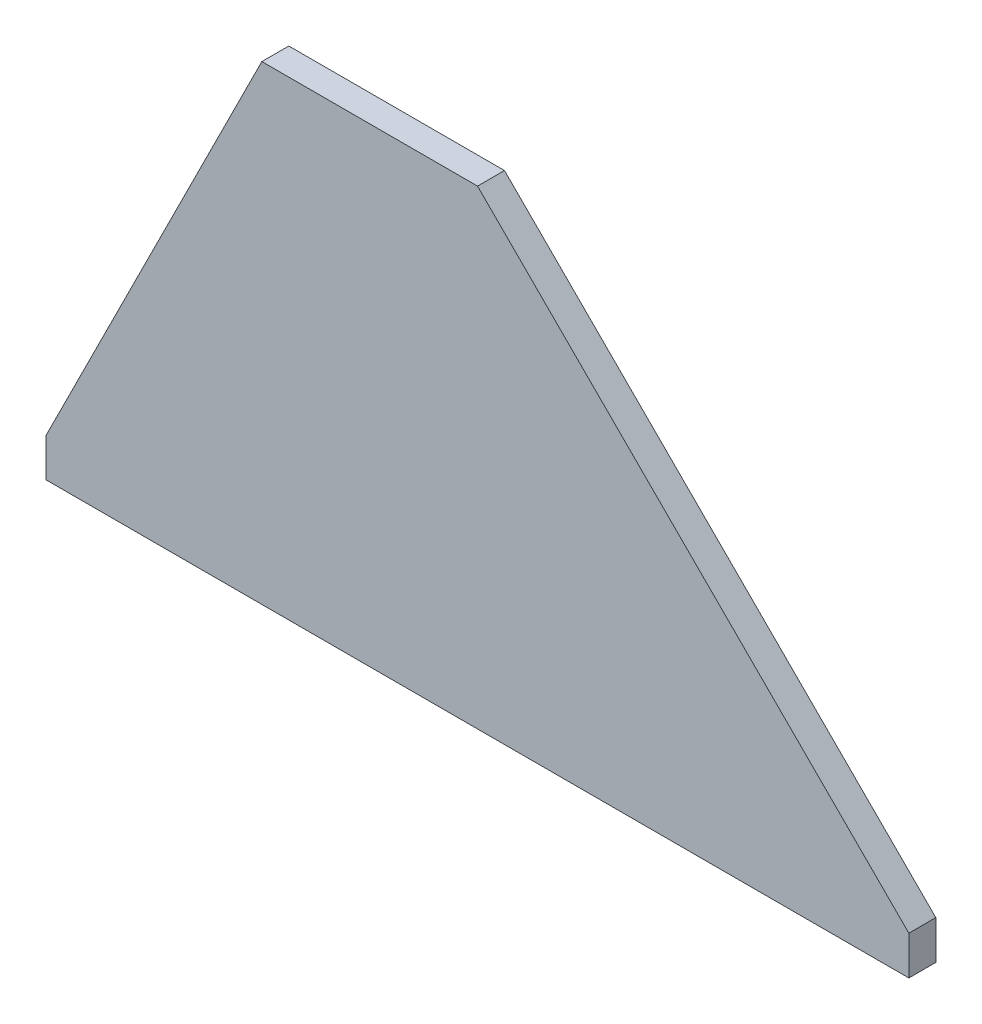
ISO-10303-21;
HEADER;
FILE_DESCRIPTION(('STEP AP214'),'2;1');
FILE_NAME('part.step','',(''),(''),'','','');
FILE_SCHEMA(('AUTOMOTIVE_DESIGN { 1 0 10303 214 1 1 1 1 }'));
ENDSEC;
DATA;
#1=APPLICATION_CONTEXT('core data for automotive mechanical design processes');
#2=APPLICATION_PROTOCOL_DEFINITION('international standard','automotive_design',2000,#1);
#3=PRODUCT_CONTEXT('',#1,'mechanical');
#4=PRODUCT('Part','Part','',(#3));
#5=PRODUCT_RELATED_PRODUCT_CATEGORY('part','',(#4));
#6=PRODUCT_DEFINITION_FORMATION('','',#4);
#7=PRODUCT_DEFINITION_CONTEXT('part definition',#1,'design');
#8=PRODUCT_DEFINITION('design','',#6,#7);
#9=PRODUCT_DEFINITION_SHAPE('','',#8);
#10=(LENGTH_UNIT() NAMED_UNIT(*) SI_UNIT(.MILLI.,.METRE.));
#11=(NAMED_UNIT(*) PLANE_ANGLE_UNIT() SI_UNIT($,.RADIAN.));
#12=(NAMED_UNIT(*) SI_UNIT($,.STERADIAN.) SOLID_ANGLE_UNIT());
#13=UNCERTAINTY_MEASURE_WITH_UNIT(LENGTH_MEASURE(1.E-05),#10,'distance_accuracy_value','');
#14=(GEOMETRIC_REPRESENTATION_CONTEXT(3) GLOBAL_UNCERTAINTY_ASSIGNED_CONTEXT((#13)) GLOBAL_UNIT_ASSIGNED_CONTEXT((#10,
#11,#12)) REPRESENTATION_CONTEXT('',''));
#15=CARTESIAN_POINT('',(0.,0.,0.));
#16=DIRECTION('',(0.,0.,1.));
#17=DIRECTION('',(1.,0.,0.));
#18=AXIS2_PLACEMENT_3D('',#15,#16,#17);
#19=CARTESIAN_POINT('',(0.,-4.572,3.175));
#20=DIRECTION('',(1.,0.,0.));
#21=DIRECTION('',(0.,0.,-1.));
#22=AXIS2_PLACEMENT_3D('',#19,#20,#21);
#23=PLANE('',#22);
#24=DIRECTION('',(0.,-1.,0.));
#25=VECTOR('',#24,1.);
#26=CARTESIAN_POINT('',(0.,-4.572,0.));
#27=LINE('',#26,#25);
#28=CARTESIAN_POINT('',(0.,0.,0.));
#29=VERTEX_POINT('',#28);
#30=CARTESIAN_POINT('',(0.,-4.572,0.));
#31=VERTEX_POINT('',#30);
#32=EDGE_CURVE('E87',#29,#31,#27,.T.);
#33=ORIENTED_EDGE('',*,*,#32,.T.);
#34=DIRECTION('',(0.,0.,-1.));
#35=VECTOR('',#34,1.);
#36=CARTESIAN_POINT('',(0.,-4.572,3.175));
#37=LINE('',#36,#35);
#38=CARTESIAN_POINT('',(0.,-4.572,3.175));
#39=VERTEX_POINT('',#38);
#40=EDGE_CURVE('E11',#39,#31,#37,.T.);
#41=ORIENTED_EDGE('',*,*,#40,.F.);
#42=DIRECTION('',(0.,-1.,0.));
#43=VECTOR('',#42,1.);
#44=CARTESIAN_POINT('',(0.,-4.572,3.175));
#45=LINE('',#44,#43);
#46=CARTESIAN_POINT('',(0.,0.,3.175));
#47=VERTEX_POINT('',#46);
#48=EDGE_CURVE('E110',#47,#39,#45,.T.);
#49=ORIENTED_EDGE('',*,*,#48,.F.);
#50=DIRECTION('',(0.,0.,-1.));
#51=VECTOR('',#50,1.);
#52=CARTESIAN_POINT('',(0.,0.,3.175));
#53=LINE('',#52,#51);
#54=EDGE_CURVE('E100',#47,#29,#53,.T.);
#55=ORIENTED_EDGE('',*,*,#54,.T.);
#56=EDGE_LOOP('',(#33,#41,#49,#55));
#57=FACE_BOUND('',#56,.T.);
#58=ADVANCED_FACE('F31',(#57),#23,.F.);
#59=CARTESIAN_POINT('',(0.,-4.572,3.175));
#60=DIRECTION('',(0.,1.,0.));
#61=DIRECTION('',(0.,0.,1.));
#62=AXIS2_PLACEMENT_3D('',#59,#60,#61);
#63=PLANE('',#62);
#64=DIRECTION('',(1.,0.,0.));
#65=VECTOR('',#64,1.);
#66=CARTESIAN_POINT('',(0.,-4.572,0.));
#67=LINE('',#66,#65);
#68=CARTESIAN_POINT('',(101.6,-4.572,0.));
#69=VERTEX_POINT('',#68);
#70=EDGE_CURVE('E83',#31,#69,#67,.T.);
#71=ORIENTED_EDGE('',*,*,#70,.T.);
#72=DIRECTION('',(0.,0.,-1.));
#73=VECTOR('',#72,1.);
#74=CARTESIAN_POINT('',(101.6,-4.572,3.175));
#75=LINE('',#74,#73);
#76=CARTESIAN_POINT('',(101.6,-4.572,3.175));
#77=VERTEX_POINT('',#76);
#78=EDGE_CURVE('E38',#77,#69,#75,.T.);
#79=ORIENTED_EDGE('',*,*,#78,.F.);
#80=DIRECTION('',(1.,0.,0.));
#81=VECTOR('',#80,1.);
#82=CARTESIAN_POINT('',(0.,-4.572,3.175));
#83=LINE('',#82,#81);
#84=EDGE_CURVE('E96',#39,#77,#83,.T.);
#85=ORIENTED_EDGE('',*,*,#84,.F.);
#86=ORIENTED_EDGE('',*,*,#40,.T.);
#87=EDGE_LOOP('',(#71,#79,#85,#86));
#88=FACE_BOUND('',#87,.T.);
#89=ADVANCED_FACE('F95',(#88),#63,.F.);
#90=CARTESIAN_POINT('',(101.6,0.,3.175));
#91=DIRECTION('',(-1.,0.,0.));
#92=DIRECTION('',(0.,0.,1.));
#93=AXIS2_PLACEMENT_3D('',#90,#91,#92);
#94=PLANE('',#93);
#95=DIRECTION('',(0.,1.,0.));
#96=VECTOR('',#95,1.);
#97=CARTESIAN_POINT('',(101.6,0.,0.));
#98=LINE('',#97,#96);
#99=CARTESIAN_POINT('',(101.6,0.,0.));
#100=VERTEX_POINT('',#99);
#101=EDGE_CURVE('E89',#69,#100,#98,.T.);
#102=ORIENTED_EDGE('',*,*,#101,.T.);
#103=DIRECTION('',(0.,0.,-1.));
#104=VECTOR('',#103,1.);
#105=CARTESIAN_POINT('',(101.6,0.,3.175));
#106=LINE('',#105,#104);
#107=CARTESIAN_POINT('',(101.6,0.,3.175));
#108=VERTEX_POINT('',#107);
#109=EDGE_CURVE('E126',#108,#100,#106,.T.);
#110=ORIENTED_EDGE('',*,*,#109,.F.);
#111=DIRECTION('',(0.,1.,0.));
#112=VECTOR('',#111,1.);
#113=CARTESIAN_POINT('',(101.6,0.,3.175));
#114=LINE('',#113,#112);
#115=EDGE_CURVE('E113',#77,#108,#114,.T.);
#116=ORIENTED_EDGE('',*,*,#115,.F.);
#117=ORIENTED_EDGE('',*,*,#78,.T.);
#118=EDGE_LOOP('',(#102,#110,#116,#117));
#119=FACE_BOUND('',#118,.T.);
#120=ADVANCED_FACE('F130',(#119),#94,.F.);
#121=CARTESIAN_POINT('',(101.6,0.,3.175));
#122=DIRECTION('',(-0.707106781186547,-0.707106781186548,0.));
#123=DIRECTION('',(0.707106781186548,-0.707106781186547,0.));
#124=AXIS2_PLACEMENT_3D('',#121,#122,#123);
#125=PLANE('',#124);
#126=DIRECTION('',(-0.707106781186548,0.707106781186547,0.));
#127=VECTOR('',#126,1.);
#128=CARTESIAN_POINT('',(101.6,0.,0.));
#129=LINE('',#128,#127);
#130=CARTESIAN_POINT('',(50.8,50.8,0.));
#131=VERTEX_POINT('',#130);
#132=EDGE_CURVE('E104',#100,#131,#129,.T.);
#133=ORIENTED_EDGE('',*,*,#132,.T.);
#134=DIRECTION('',(0.,0.,-1.));
#135=VECTOR('',#134,1.);
#136=CARTESIAN_POINT('',(50.8,50.8,3.175));
#137=LINE('',#136,#135);
#138=CARTESIAN_POINT('',(50.8,50.8,3.175));
#139=VERTEX_POINT('',#138);
#140=EDGE_CURVE('E123',#139,#131,#137,.T.);
#141=ORIENTED_EDGE('',*,*,#140,.F.);
#142=DIRECTION('',(-0.707106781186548,0.707106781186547,0.));
#143=VECTOR('',#142,1.);
#144=CARTESIAN_POINT('',(101.6,0.,3.175));
#145=LINE('',#144,#143);
#146=EDGE_CURVE('E115',#108,#139,#145,.T.);
#147=ORIENTED_EDGE('',*,*,#146,.F.);
#148=ORIENTED_EDGE('',*,*,#109,.T.);
#149=EDGE_LOOP('',(#133,#141,#147,#148));
#150=FACE_BOUND('',#149,.T.);
#151=ADVANCED_FACE('F136',(#150),#125,.F.);
#152=CARTESIAN_POINT('',(50.8,50.8,3.175));
#153=DIRECTION('',(0.,-1.,0.));
#154=DIRECTION('',(0.,0.,-1.));
#155=AXIS2_PLACEMENT_3D('',#152,#153,#154);
#156=PLANE('',#155);
#157=DIRECTION('',(-1.,0.,0.));
#158=VECTOR('',#157,1.);
#159=CARTESIAN_POINT('',(50.8,50.8,0.));
#160=LINE('',#159,#158);
#161=CARTESIAN_POINT('',(25.4,50.8,0.));
#162=VERTEX_POINT('',#161);
#163=EDGE_CURVE('E106',#131,#162,#160,.T.);
#164=ORIENTED_EDGE('',*,*,#163,.T.);
#165=DIRECTION('',(0.,0.,-1.));
#166=VECTOR('',#165,1.);
#167=CARTESIAN_POINT('',(25.4,50.8,3.175));
#168=LINE('',#167,#166);
#169=CARTESIAN_POINT('',(25.4,50.8,3.175));
#170=VERTEX_POINT('',#169);
#171=EDGE_CURVE('E120',#170,#162,#168,.T.);
#172=ORIENTED_EDGE('',*,*,#171,.F.);
#173=DIRECTION('',(-1.,0.,0.));
#174=VECTOR('',#173,1.);
#175=CARTESIAN_POINT('',(50.8,50.8,3.175));
#176=LINE('',#175,#174);
#177=EDGE_CURVE('E50',#139,#170,#176,.T.);
#178=ORIENTED_EDGE('',*,*,#177,.F.);
#179=ORIENTED_EDGE('',*,*,#140,.T.);
#180=EDGE_LOOP('',(#164,#172,#178,#179));
#181=FACE_BOUND('',#180,.T.);
#182=ADVANCED_FACE('F139',(#181),#156,.F.);
#183=CARTESIAN_POINT('',(25.4,50.8,3.175));
#184=DIRECTION('',(0.894427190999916,-0.447213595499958,0.));
#185=DIRECTION('',(0.447213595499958,0.894427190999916,0.));
#186=AXIS2_PLACEMENT_3D('',#183,#184,#185);
#187=PLANE('',#186);
#188=DIRECTION('',(-0.447213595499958,-0.894427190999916,0.));
#189=VECTOR('',#188,1.);
#190=CARTESIAN_POINT('',(25.4,50.8,0.));
#191=LINE('',#190,#189);
#192=EDGE_CURVE('E108',#162,#29,#191,.T.);
#193=ORIENTED_EDGE('',*,*,#192,.T.);
#194=ORIENTED_EDGE('',*,*,#54,.F.);
#195=DIRECTION('',(-0.447213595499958,-0.894427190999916,0.));
#196=VECTOR('',#195,1.);
#197=CARTESIAN_POINT('',(25.4,50.8,3.175));
#198=LINE('',#197,#196);
#199=EDGE_CURVE('E45',#170,#47,#198,.T.);
#200=ORIENTED_EDGE('',*,*,#199,.F.);
#201=ORIENTED_EDGE('',*,*,#171,.T.);
#202=EDGE_LOOP('',(#193,#194,#200,#201));
#203=FACE_BOUND('',#202,.T.);
#204=ADVANCED_FACE('F141',(#203),#187,.F.);
#205=CARTESIAN_POINT('',(0.,50.8,3.175));
#206=DIRECTION('',(0.,0.,1.));
#207=DIRECTION('',(1.,0.,0.));
#208=AXIS2_PLACEMENT_3D('',#205,#206,#207);
#209=PLANE('',#208);
#210=ORIENTED_EDGE('',*,*,#48,.T.);
#211=ORIENTED_EDGE('',*,*,#84,.T.);
#212=ORIENTED_EDGE('',*,*,#115,.T.);
#213=ORIENTED_EDGE('',*,*,#146,.T.);
#214=ORIENTED_EDGE('',*,*,#177,.T.);
#215=ORIENTED_EDGE('',*,*,#199,.T.);
#216=EDGE_LOOP('',(#210,#211,#212,#213,#214,#215));
#217=FACE_BOUND('',#216,.T.);
#218=ADVANCED_FACE('F133',(#217),#209,.T.);
#219=CARTESIAN_POINT('',(0.,50.8,0.));
#220=DIRECTION('',(0.,0.,1.));
#221=DIRECTION('',(1.,0.,0.));
#222=AXIS2_PLACEMENT_3D('',#219,#220,#221);
#223=PLANE('',#222);
#224=ORIENTED_EDGE('',*,*,#32,.F.);
#225=ORIENTED_EDGE('',*,*,#192,.F.);
#226=ORIENTED_EDGE('',*,*,#163,.F.);
#227=ORIENTED_EDGE('',*,*,#132,.F.);
#228=ORIENTED_EDGE('',*,*,#101,.F.);
#229=ORIENTED_EDGE('',*,*,#70,.F.);
#230=EDGE_LOOP('',(#224,#225,#226,#227,#228,#229));
#231=FACE_BOUND('',#230,.T.);
#232=ADVANCED_FACE('F84',(#231),#223,.F.);
#233=CLOSED_SHELL('',(#58,#89,#120,#151,#182,#204,#218,#232));
#234=MANIFOLD_SOLID_BREP('B2',#233);
#235=ADVANCED_BREP_SHAPE_REPRESENTATION('',(#18,#234),#14);
#236=SHAPE_DEFINITION_REPRESENTATION(#9,#235);
ENDSEC;
END-ISO-10303-21;
